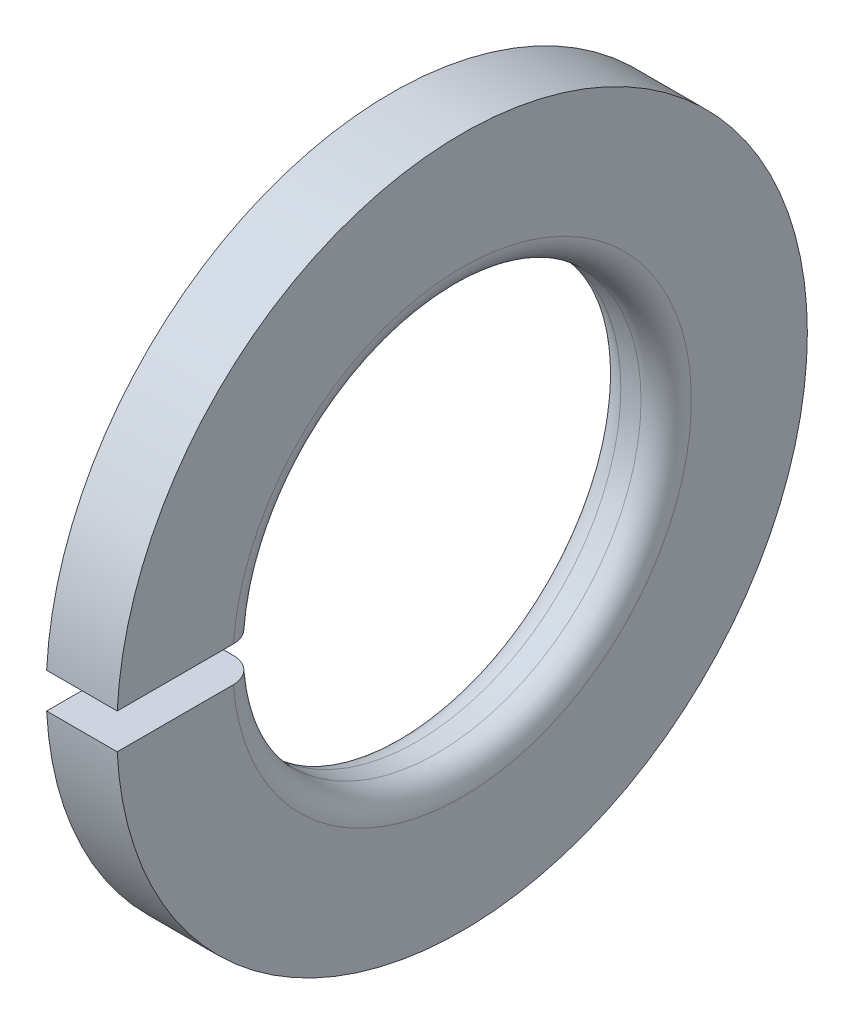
ISO-10303-21;
HEADER;
FILE_DESCRIPTION(('STEP AP214'),'2;1');
FILE_NAME('part.step','',(''),(''),'','','');
FILE_SCHEMA(('AUTOMOTIVE_DESIGN { 1 0 10303 214 1 1 1 1 }'));
ENDSEC;
DATA;
#1=APPLICATION_CONTEXT('core data for automotive mechanical design processes');
#2=APPLICATION_PROTOCOL_DEFINITION('international standard','automotive_design',2000,#1);
#3=PRODUCT_CONTEXT('',#1,'mechanical');
#4=PRODUCT('Part','Part','',(#3));
#5=PRODUCT_RELATED_PRODUCT_CATEGORY('part','',(#4));
#6=PRODUCT_DEFINITION_FORMATION('','',#4);
#7=PRODUCT_DEFINITION_CONTEXT('part definition',#1,'design');
#8=PRODUCT_DEFINITION('design','',#6,#7);
#9=PRODUCT_DEFINITION_SHAPE('','',#8);
#10=(LENGTH_UNIT() NAMED_UNIT(*) SI_UNIT(.MILLI.,.METRE.));
#11=(NAMED_UNIT(*) PLANE_ANGLE_UNIT() SI_UNIT($,.RADIAN.));
#12=(NAMED_UNIT(*) SI_UNIT($,.STERADIAN.) SOLID_ANGLE_UNIT());
#13=UNCERTAINTY_MEASURE_WITH_UNIT(LENGTH_MEASURE(1.E-05),#10,'distance_accuracy_value','');
#14=(GEOMETRIC_REPRESENTATION_CONTEXT(3) GLOBAL_UNCERTAINTY_ASSIGNED_CONTEXT((#13)) GLOBAL_UNIT_ASSIGNED_CONTEXT((#10,
#11,#12)) REPRESENTATION_CONTEXT('',''));
#15=CARTESIAN_POINT('',(0.,0.,0.));
#16=DIRECTION('',(0.,0.,1.));
#17=DIRECTION('',(1.,0.,0.));
#18=AXIS2_PLACEMENT_3D('',#15,#16,#17);
#19=CARTESIAN_POINT('',(-34.9249999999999,0.,0.));
#20=DIRECTION('',(-1.,0.,0.));
#21=DIRECTION('',(0.,0.,1.));
#22=AXIS2_PLACEMENT_3D('',#19,#20,#21);
#23=CYLINDRICAL_SURFACE('',#22,13.7);
#24=DIRECTION('',(-1.,0.,0.));
#25=VECTOR('',#24,1.);
#26=CARTESIAN_POINT('',(-34.9249999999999,0.7,13.6821051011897));
#27=LINE('',#26,#25);
#28=CARTESIAN_POINT('',(0.,0.7,13.6821051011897));
#29=VERTEX_POINT('',#28);
#30=CARTESIAN_POINT('',(-2.8,0.700000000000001,13.6821051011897));
#31=VERTEX_POINT('',#30);
#32=EDGE_CURVE('E46',#29,#31,#27,.T.);
#33=ORIENTED_EDGE('',*,*,#32,.F.);
#34=CARTESIAN_POINT('',(0.,0.,0.));
#35=DIRECTION('',(-1.,0.,0.));
#36=DIRECTION('',(0.,0.,1.));
#37=AXIS2_PLACEMENT_3D('',#34,#35,#36);
#38=CIRCLE('',#37,13.7);
#39=CARTESIAN_POINT('',(0.,-0.7,13.6821051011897));
#40=VERTEX_POINT('',#39);
#41=EDGE_CURVE('E107',#29,#40,#38,.T.);
#42=ORIENTED_EDGE('',*,*,#41,.T.);
#43=DIRECTION('',(-1.,0.,0.));
#44=VECTOR('',#43,1.);
#45=CARTESIAN_POINT('',(-34.9249999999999,-0.7,13.6821051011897));
#46=LINE('',#45,#44);
#47=CARTESIAN_POINT('',(-2.8,-0.7,13.6821051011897));
#48=VERTEX_POINT('',#47);
#49=EDGE_CURVE('E88',#48,#40,#46,.F.);
#50=ORIENTED_EDGE('',*,*,#49,.F.);
#51=CARTESIAN_POINT('',(-2.8,0.,0.));
#52=DIRECTION('',(-1.,0.,0.));
#53=DIRECTION('',(0.,0.,1.));
#54=AXIS2_PLACEMENT_3D('',#51,#52,#53);
#55=CIRCLE('',#54,13.7);
#56=EDGE_CURVE('E119',#31,#48,#55,.T.);
#57=ORIENTED_EDGE('',*,*,#56,.F.);
#58=EDGE_LOOP('',(#33,#42,#50,#57));
#59=FACE_BOUND('',#58,.T.);
#60=ADVANCED_FACE('F33',(#59),#23,.T.);
#61=CARTESIAN_POINT('',(0.,9.1,0.));
#62=DIRECTION('',(-1.,0.,0.));
#63=DIRECTION('',(0.,0.,1.));
#64=AXIS2_PLACEMENT_3D('',#61,#62,#63);
#65=PLANE('',#64);
#66=DIRECTION('',(0.,0.,-1.));
#67=VECTOR('',#66,1.);
#68=CARTESIAN_POINT('',(0.,0.7,13.974));
#69=LINE('',#68,#67);
#70=CARTESIAN_POINT('',(0.,0.7,9.073036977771));
#71=VERTEX_POINT('',#70);
#72=EDGE_CURVE('E93',#29,#71,#69,.T.);
#73=ORIENTED_EDGE('',*,*,#72,.T.);
#74=CARTESIAN_POINT('',(0.,0.,0.));
#75=DIRECTION('',(-1.,0.,0.));
#76=DIRECTION('',(0.,0.,1.));
#77=AXIS2_PLACEMENT_3D('',#74,#75,#76);
#78=CIRCLE('',#77,9.1);
#79=CARTESIAN_POINT('',(0.,-0.7,9.073036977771));
#80=VERTEX_POINT('',#79);
#81=EDGE_CURVE('E100',#71,#80,#78,.T.);
#82=ORIENTED_EDGE('',*,*,#81,.T.);
#83=DIRECTION('',(0.,0.,1.));
#84=VECTOR('',#83,1.);
#85=CARTESIAN_POINT('',(0.,-0.7,0.));
#86=LINE('',#85,#84);
#87=EDGE_CURVE('E82',#80,#40,#86,.T.);
#88=ORIENTED_EDGE('',*,*,#87,.T.);
#89=ORIENTED_EDGE('',*,*,#41,.F.);
#90=EDGE_LOOP('',(#73,#82,#88,#89));
#91=FACE_BOUND('',#90,.T.);
#92=ADVANCED_FACE('F106',(#91),#65,.F.);
#93=CARTESIAN_POINT('',(-1.,0.,0.));
#94=DIRECTION('',(-1.,0.,0.));
#95=DIRECTION('',(0.,0.,1.));
#96=AXIS2_PLACEMENT_3D('',#93,#94,#95);
#97=TOROIDAL_SURFACE('',#96,9.1,1.);
#98=ORIENTED_EDGE('',*,*,#81,.F.);
#99=CARTESIAN_POINT('',(-0.662612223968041,0.7,8.12854923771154));
#100=CARTESIAN_POINT('',(-0.715290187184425,0.7,8.10960209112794));
#101=CARTESIAN_POINT('',(-0.769604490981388,0.7,8.09508547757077));
#102=CARTESIAN_POINT('',(-0.879943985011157,0.7,8.07536673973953));
#103=CARTESIAN_POINT('',(-0.935971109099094,0.7,8.07017557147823));
#104=CARTESIAN_POINT('',(-1.04808100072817,0.7,8.06928105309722));
#105=CARTESIAN_POINT('',(-1.10416373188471,0.7,8.07357343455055));
#106=CARTESIAN_POINT('',(-1.21479686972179,0.7,8.09151311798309));
#107=CARTESIAN_POINT('',(-1.26934764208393,0.7,8.10515816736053));
#108=CARTESIAN_POINT('',(-1.37539140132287,0.7,8.1414051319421));
#109=CARTESIAN_POINT('',(-1.42688417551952,0.7,8.164007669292));
#110=CARTESIAN_POINT('',(-1.52535824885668,0.7,8.21751835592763));
#111=CARTESIAN_POINT('',(-1.57233933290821,0.7,8.24842690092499));
#112=CARTESIAN_POINT('',(-1.66057357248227,0.7,8.31774363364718));
#113=CARTESIAN_POINT('',(-1.70181327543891,0.7,8.35616894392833));
#114=CARTESIAN_POINT('',(-1.77728353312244,0.7,8.43937649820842));
#115=CARTESIAN_POINT('',(-1.81151397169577,0.7,8.48415884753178));
#116=CARTESIAN_POINT('',(-1.872118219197,0.7,8.57897480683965));
#117=CARTESIAN_POINT('',(-1.89846459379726,0.7,8.62902595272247));
#118=CARTESIAN_POINT('',(-1.94240697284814,0.7,8.73283232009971));
#119=CARTESIAN_POINT('',(-1.9600028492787,0.7,8.78658759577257));
#120=CARTESIAN_POINT('',(-1.98598908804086,0.7,8.89643434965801));
#121=CARTESIAN_POINT('',(-1.99435421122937,0.7,8.95253180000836));
#122=CARTESIAN_POINT('',(-2.001556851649,0.7,9.06533538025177));
#123=CARTESIAN_POINT('',(-2.00039428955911,0.7,9.12204151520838));
#124=CARTESIAN_POINT('',(-1.98856554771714,0.7,9.23450309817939));
#125=CARTESIAN_POINT('',(-1.97789128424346,0.7,9.29025769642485));
#126=CARTESIAN_POINT('',(-1.94732360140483,0.7,9.39917999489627));
#127=CARTESIAN_POINT('',(-1.92743021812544,0.7,9.45234770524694));
#128=CARTESIAN_POINT('',(-1.87900768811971,0.7,9.5545218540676));
#129=CARTESIAN_POINT('',(-1.85048808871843,0.7,9.6035328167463));
#130=CARTESIAN_POINT('',(-1.78560729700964,0.7,9.6960563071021));
#131=CARTESIAN_POINT('',(-1.74924619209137,0.7,9.73956889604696));
#132=CARTESIAN_POINT('',(-1.66980388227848,0.7,9.8197515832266));
#133=CARTESIAN_POINT('',(-1.62673846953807,0.7,9.85643732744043));
#134=CARTESIAN_POINT('',(-1.53504671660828,0.7,9.92203619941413));
#135=CARTESIAN_POINT('',(-1.4864204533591,0.7,9.95094943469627));
#136=CARTESIAN_POINT('',(-1.38511893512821,0.7,10.0001070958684));
#137=CARTESIAN_POINT('',(-1.33245416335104,0.7,10.0203731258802));
#138=CARTESIAN_POINT('',(-1.22446613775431,0.7,10.0517577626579));
#139=CARTESIAN_POINT('',(-1.16914291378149,0.7,10.0628764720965));
#140=CARTESIAN_POINT('',(-1.05751558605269,0.7,10.0756341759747));
#141=CARTESIAN_POINT('',(-1.00121343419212,0.7,10.0772902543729));
#142=CARTESIAN_POINT('',(-0.88913124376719,0.7,10.0711209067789));
#143=CARTESIAN_POINT('',(-0.833351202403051,0.7,10.0632955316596));
#144=CARTESIAN_POINT('',(-0.723927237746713,0.7,10.0383952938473));
#145=CARTESIAN_POINT('',(-0.670282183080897,0.7,10.0213254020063));
#146=CARTESIAN_POINT('',(-0.566615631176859,0.7,9.97842937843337));
#147=CARTESIAN_POINT('',(-0.516594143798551,0.7,9.95260322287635));
#148=CARTESIAN_POINT('',(-0.421544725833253,0.7,9.89290726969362));
#149=CARTESIAN_POINT('',(-0.376521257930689,0.7,9.8590303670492));
#150=CARTESIAN_POINT('',(-0.292786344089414,0.7,9.78421280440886));
#151=CARTESIAN_POINT('',(-0.254074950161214,0.7,9.74327208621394));
#152=CARTESIAN_POINT('',(-0.183976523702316,0.7,9.65540102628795));
#153=CARTESIAN_POINT('',(-0.152604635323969,0.7,9.60845860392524));
#154=CARTESIAN_POINT('',(-0.0981636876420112,0.7,9.50998372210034));
#155=CARTESIAN_POINT('',(-0.0750947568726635,0.7,9.45845119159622));
#156=CARTESIAN_POINT('',(-0.0378528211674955,0.7,9.35211817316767));
#157=CARTESIAN_POINT('',(-0.0237026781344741,0.7,9.29730967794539));
#158=CARTESIAN_POINT('',(-0.00478318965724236,0.7,9.18609666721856));
#159=CARTESIAN_POINT('',(-1.39876148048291E-05,0.7,9.12969212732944));
#160=CARTESIAN_POINT('',(1.39556668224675E-05,0.7,9.01675985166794));
#161=CARTESIAN_POINT('',(-0.00474764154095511,0.7,8.96023211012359));
#162=CARTESIAN_POINT('',(-0.0236862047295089,0.7,8.84877833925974));
#163=CARTESIAN_POINT('',(-0.0378628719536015,0.7,8.79385225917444));
#164=CARTESIAN_POINT('',(-0.0752439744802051,0.7,8.68712722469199));
#165=CARTESIAN_POINT('',(-0.0984536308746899,0.7,8.63533009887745));
#166=CARTESIAN_POINT('',(-0.153257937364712,0.7,8.53636087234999));
#167=CARTESIAN_POINT('',(-0.184854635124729,0.7,8.48918990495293));
#168=CARTESIAN_POINT('',(-0.255503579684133,0.7,8.40088177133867));
#169=CARTESIAN_POINT('',(-0.294549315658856,0.7,8.35973939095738));
#170=CARTESIAN_POINT('',(-0.378985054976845,0.7,8.28465942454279));
#171=CARTESIAN_POINT('',(-0.424367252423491,0.7,8.25071310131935));
#172=CARTESIAN_POINT('',(-0.502233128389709,0.7,8.20215332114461));
#173=CARTESIAN_POINT('',(-0.533197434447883,0.7,8.18505636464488));
#174=CARTESIAN_POINT('',(-0.596761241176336,0.7,8.15423425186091));
#175=CARTESIAN_POINT('',(-0.62936073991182,0.7,8.14050909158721));
#176=CARTESIAN_POINT('',(-0.662612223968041,0.7,8.12854923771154));
#177=B_SPLINE_CURVE_WITH_KNOTS('',3,(#99,#100,#101,#102,#103,#104,#105,#106,#107,#108,#109,#110,
#111,#112,#113,#114,#115,#116,#117,#118,#119,#120,#121,#122,#123,#124,#125,#126,#127,#128,#129,
#130,#131,#132,#133,#134,#135,#136,#137,#138,#139,#140,#141,#142,#143,#144,#145,#146,#147,#148,
#149,#150,#151,#152,#153,#154,#155,#156,#157,#158,#159,#160,#161,#162,#163,#164,#165,#166,#167,
#168,#169,#170,#171,#172,#173,#174,#175,#176),.UNSPECIFIED.,.T.,.F.,(4,2,2,2,2,2,2,2,2,2,2,2,2,
2,2,2,2,2,2,2,2,2,2,2,2,2,2,2,2,2,2,2,2,2,2,2,2,2,4),(0.,0.167816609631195,0.335830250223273,
0.503768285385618,0.671665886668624,0.839575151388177,1.0074924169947,1.17579673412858,
1.34410384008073,1.51298997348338,1.68187857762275,1.85122782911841,2.02057849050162,
2.19007321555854,2.35956727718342,2.5288744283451,2.69817969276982,2.86709202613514,
3.03600202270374,3.20448750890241,3.3729711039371,3.54115042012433,3.70932883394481,
3.87741690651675,4.04550543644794,4.21374286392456,4.38198167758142,4.55056462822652,
4.7191501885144,4.88816615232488,5.05718469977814,5.22656431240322,5.39593855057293,
5.5654108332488,5.73492453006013,5.9042907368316,6.07345011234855,6.17937975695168,
6.28530927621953),.UNSPECIFIED.);
#178=CARTESIAN_POINT('',(-1.,0.7,8.06969640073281));
#179=VERTEX_POINT('',#178);
#180=EDGE_CURVE('E126',#71,#179,#177,.T.);
#181=ORIENTED_EDGE('',*,*,#180,.T.);
#182=CARTESIAN_POINT('',(-1.,0.,0.));
#183=DIRECTION('',(-1.,0.,0.));
#184=DIRECTION('',(0.,0.,1.));
#185=AXIS2_PLACEMENT_3D('',#182,#183,#184);
#186=CIRCLE('',#185,8.1);
#187=CARTESIAN_POINT('',(-1.,-0.7,8.06969640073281));
#188=VERTEX_POINT('',#187);
#189=EDGE_CURVE('E102',#179,#188,#186,.T.);
#190=ORIENTED_EDGE('',*,*,#189,.T.);
#191=CARTESIAN_POINT('',(-0.662612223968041,-0.7,8.12854923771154));
#192=CARTESIAN_POINT('',(-0.609750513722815,-0.7,8.14756782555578));
#193=CARTESIAN_POINT('',(-0.558459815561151,-0.7,8.17107597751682));
#194=CARTESIAN_POINT('',(-0.460516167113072,-0.7,8.22639837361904));
#195=CARTESIAN_POINT('',(-0.41386902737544,-0.7,8.25822284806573));
#196=CARTESIAN_POINT('',(-0.326601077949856,-0.7,8.32922967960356));
#197=CARTESIAN_POINT('',(-0.285976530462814,-0.7,8.36840743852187));
#198=CARTESIAN_POINT('',(-0.211872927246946,-0.7,8.45300084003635));
#199=CARTESIAN_POINT('',(-0.178392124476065,-0.7,8.49841495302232));
#200=CARTESIAN_POINT('',(-0.119415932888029,-0.7,8.59432631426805));
#201=CARTESIAN_POINT('',(-0.0939416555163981,-0.7,8.64483654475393));
#202=CARTESIAN_POINT('',(-0.0518077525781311,-0.7,8.74941094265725));
#203=CARTESIAN_POINT('',(-0.0351486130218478,-0.7,8.80347530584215));
#204=CARTESIAN_POINT('',(-0.0110795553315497,-0.7,8.91377475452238));
#205=CARTESIAN_POINT('',(-0.00369410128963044,-0.7,8.97001517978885));
#206=CARTESIAN_POINT('',(0.00153797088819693,-0.7,9.08293817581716));
#207=CARTESIAN_POINT('',(-0.000615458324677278,-0.7,9.13962074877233));
#208=CARTESIAN_POINT('',(-0.0144095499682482,-0.7,9.25186291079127));
#209=CARTESIAN_POINT('',(-0.0260572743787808,-0.7,9.30742163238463));
#210=CARTESIAN_POINT('',(-0.0585259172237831,-0.7,9.41579093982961));
#211=CARTESIAN_POINT('',(-0.0793467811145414,-0.7,9.46860154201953));
#212=CARTESIAN_POINT('',(-0.129548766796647,-0.7,9.56990606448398));
#213=CARTESIAN_POINT('',(-0.158919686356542,-0.7,9.61840504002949));
#214=CARTESIAN_POINT('',(-0.225405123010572,-0.7,9.70976838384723));
#215=CARTESIAN_POINT('',(-0.262519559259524,-0.7,9.75263281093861));
#216=CARTESIAN_POINT('',(-0.343345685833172,-0.7,9.83140145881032));
#217=CARTESIAN_POINT('',(-0.387041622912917,-0.7,9.86732184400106));
#218=CARTESIAN_POINT('',(-0.47985649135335,-0.7,9.93129490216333));
#219=CARTESIAN_POINT('',(-0.528975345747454,-0.7,9.95934768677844));
#220=CARTESIAN_POINT('',(-0.631109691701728,-0.7,10.0067167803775));
#221=CARTESIAN_POINT('',(-0.684115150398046,-0.7,10.0260547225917));
#222=CARTESIAN_POINT('',(-0.792623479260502,-0.7,10.0555396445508));
#223=CARTESIAN_POINT('',(-0.848126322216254,-0.7,10.0656867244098));
#224=CARTESIAN_POINT('',(-0.959949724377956,-0.7,10.0764877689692));
#225=CARTESIAN_POINT('',(-1.0162686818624,-0.7,10.0771583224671));
#226=CARTESIAN_POINT('',(-1.12821880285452,-0.7,10.0690298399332));
#227=CARTESIAN_POINT('',(-1.18384996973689,-0.7,10.0602308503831));
#228=CARTESIAN_POINT('',(-1.29281928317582,-0.7,10.0334227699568));
#229=CARTESIAN_POINT('',(-1.34615848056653,-0.7,10.015417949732));
#230=CARTESIAN_POINT('',(-1.4490611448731,-0.7,9.970717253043));
#231=CARTESIAN_POINT('',(-1.49862460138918,-0.7,9.94402135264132));
#232=CARTESIAN_POINT('',(-1.59262209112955,-0.7,9.88267285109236));
#233=CARTESIAN_POINT('',(-1.63705117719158,-0.7,9.84801267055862));
#234=CARTESIAN_POINT('',(-1.71947489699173,-0.7,9.77173948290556));
#235=CARTESIAN_POINT('',(-1.75746946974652,-0.7,9.73012640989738));
#236=CARTESIAN_POINT('',(-1.82603230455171,-0.7,9.64103705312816));
#237=CARTESIAN_POINT('',(-1.85658487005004,-0.7,9.59354868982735));
#238=CARTESIAN_POINT('',(-1.90930732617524,-0.7,9.49412689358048));
#239=CARTESIAN_POINT('',(-1.93147709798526,-0.7,9.44219339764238));
#240=CARTESIAN_POINT('',(-1.96686389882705,-0.7,9.33521335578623));
#241=CARTESIAN_POINT('',(-1.98005788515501,-0.7,9.28015918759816));
#242=CARTESIAN_POINT('',(-1.99703688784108,-0.7,9.16861858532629));
#243=CARTESIAN_POINT('',(-2.00082178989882,-0.7,9.11213213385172));
#244=CARTESIAN_POINT('',(-1.99887833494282,-0.7,8.99920600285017));
#245=CARTESIAN_POINT('',(-1.99313030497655,-0.7,8.94276666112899));
#246=CARTESIAN_POINT('',(-1.97224664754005,-0.7,8.83165188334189));
#247=CARTESIAN_POINT('',(-1.95711093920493,-0.7,8.77697646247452));
#248=CARTESIAN_POINT('',(-1.91786481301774,-0.7,8.67091052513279));
#249=CARTESIAN_POINT('',(-1.89374914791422,-0.7,8.61952194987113));
#250=CARTESIAN_POINT('',(-1.83722070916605,-0.7,8.52153046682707));
#251=CARTESIAN_POINT('',(-1.80480795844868,-0.7,8.474927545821));
#252=CARTESIAN_POINT('',(-1.73264985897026,-0.7,8.3879067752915));
#253=CARTESIAN_POINT('',(-1.69291510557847,-0.7,8.347480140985));
#254=CARTESIAN_POINT('',(-1.60720532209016,-0.7,8.27389845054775));
#255=CARTESIAN_POINT('',(-1.56123063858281,-0.7,8.24074299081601));
#256=CARTESIAN_POINT('',(-1.46450243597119,-0.7,8.18275770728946));
#257=CARTESIAN_POINT('',(-1.4137647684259,-0.7,8.15790143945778));
#258=CARTESIAN_POINT('',(-1.30881264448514,-0.7,8.11708643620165));
#259=CARTESIAN_POINT('',(-1.25459739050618,-0.7,8.10112975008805));
#260=CARTESIAN_POINT('',(-1.14441413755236,-0.7,8.07862035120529));
#261=CARTESIAN_POINT('',(-1.08845152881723,-0.7,8.07204117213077));
#262=CARTESIAN_POINT('',(-0.976264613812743,-0.7,8.06840287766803));
#263=CARTESIAN_POINT('',(-0.920040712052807,-0.7,8.07133211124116));
#264=CARTESIAN_POINT('',(-0.830102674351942,-0.7,8.08367379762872));
#265=CARTESIAN_POINT('',(-0.795965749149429,-0.7,8.09019440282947));
#266=CARTESIAN_POINT('',(-0.728556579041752,-0.7,8.10675474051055));
#267=CARTESIAN_POINT('',(-0.695284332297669,-0.7,8.11679446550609));
#268=CARTESIAN_POINT('',(-0.662612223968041,-0.7,8.12854923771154));
#269=B_SPLINE_CURVE_WITH_KNOTS('',3,(#191,#192,#193,#194,#195,#196,#197,#198,#199,#200,#201,
#202,#203,#204,#205,#206,#207,#208,#209,#210,#211,#212,#213,#214,#215,#216,#217,#218,#219,#220,
#221,#222,#223,#224,#225,#226,#227,#228,#229,#230,#231,#232,#233,#234,#235,#236,#237,#238,#239,
#240,#241,#242,#243,#244,#245,#246,#247,#248,#249,#250,#251,#252,#253,#254,#255,#256,#257,#258,
#259,#260,#261,#262,#263,#264,#265,#266,#267,#268),.UNSPECIFIED.,.T.,.F.,(4,2,2,2,2,2,2,2,2,2,2,
2,2,2,2,2,2,2,2,2,2,2,2,2,2,2,2,2,2,2,2,2,2,2,2,2,2,2,4),(0.,0.16840937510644,0.337026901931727,
0.505539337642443,0.67401051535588,0.842922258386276,1.01184331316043,1.1812090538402,
1.35057563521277,1.52006830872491,1.68955997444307,1.85885021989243,2.02813869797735,
2.19702822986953,2.3659153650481,2.53438092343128,2.70284464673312,2.8710134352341,
3.03918139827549,3.20727141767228,3.37536190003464,3.54361301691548,3.71186572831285,
3.88047030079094,4.04907726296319,4.21811545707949,4.38715570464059,4.55654523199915,
4.72593621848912,4.89542634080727,5.06491599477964,5.23416228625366,5.40339918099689,
5.57209156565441,5.74082277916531,5.90907683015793,6.07712479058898,6.18121338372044,
6.28530175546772),.UNSPECIFIED.);
#270=EDGE_CURVE('E85',#188,#80,#269,.T.);
#271=ORIENTED_EDGE('',*,*,#270,.T.);
#272=EDGE_LOOP('',(#98,#181,#190,#271));
#273=FACE_BOUND('',#272,.T.);
#274=ADVANCED_FACE('F98',(#273),#97,.T.);
#275=CARTESIAN_POINT('',(-34.9249999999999,0.,0.));
#276=DIRECTION('',(-1.,0.,0.));
#277=DIRECTION('',(0.,0.,1.));
#278=AXIS2_PLACEMENT_3D('',#275,#276,#277);
#279=CYLINDRICAL_SURFACE('',#278,8.1);
#280=DIRECTION('',(-1.,0.,0.));
#281=VECTOR('',#280,1.);
#282=CARTESIAN_POINT('',(-34.9249999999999,0.7,8.06969640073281));
#283=LINE('',#282,#281);
#284=CARTESIAN_POINT('',(-1.8,0.7,8.06969640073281));
#285=VERTEX_POINT('',#284);
#286=EDGE_CURVE('E134',#285,#179,#283,.F.);
#287=ORIENTED_EDGE('',*,*,#286,.F.);
#288=CARTESIAN_POINT('',(-1.8,0.,0.));
#289=DIRECTION('',(-1.,0.,0.));
#290=DIRECTION('',(0.,0.,1.));
#291=AXIS2_PLACEMENT_3D('',#288,#289,#290);
#292=CIRCLE('',#291,8.1);
#293=CARTESIAN_POINT('',(-1.8,-0.7,8.0696964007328));
#294=VERTEX_POINT('',#293);
#295=EDGE_CURVE('E110',#285,#294,#292,.T.);
#296=ORIENTED_EDGE('',*,*,#295,.T.);
#297=DIRECTION('',(-1.,0.,0.));
#298=VECTOR('',#297,1.);
#299=CARTESIAN_POINT('',(-34.9249999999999,-0.7,8.06969640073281));
#300=LINE('',#299,#298);
#301=EDGE_CURVE('E103',#188,#294,#300,.T.);
#302=ORIENTED_EDGE('',*,*,#301,.F.);
#303=ORIENTED_EDGE('',*,*,#189,.F.);
#304=EDGE_LOOP('',(#287,#296,#302,#303));
#305=FACE_BOUND('',#304,.T.);
#306=ADVANCED_FACE('F133',(#305),#279,.F.);
#307=CARTESIAN_POINT('',(-1.8,0.,0.));
#308=DIRECTION('',(-1.,0.,0.));
#309=DIRECTION('',(0.,0.,1.));
#310=AXIS2_PLACEMENT_3D('',#307,#308,#309);
#311=TOROIDAL_SURFACE('',#310,9.1,1.);
#312=ORIENTED_EDGE('',*,*,#295,.F.);
#313=CARTESIAN_POINT('',(-2.13738777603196,0.7,8.12854923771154));
#314=CARTESIAN_POINT('',(-2.19024948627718,0.7,8.14756782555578));
#315=CARTESIAN_POINT('',(-2.24154018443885,0.7,8.17107597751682));
#316=CARTESIAN_POINT('',(-2.33948383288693,0.7,8.22639837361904));
#317=CARTESIAN_POINT('',(-2.38613097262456,0.7,8.25822284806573));
#318=CARTESIAN_POINT('',(-2.47339892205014,0.7,8.32922967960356));
#319=CARTESIAN_POINT('',(-2.51402346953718,0.7,8.36840743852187));
#320=CARTESIAN_POINT('',(-2.58812707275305,0.7,8.45300084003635));
#321=CARTESIAN_POINT('',(-2.62160787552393,0.7,8.49841495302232));
#322=CARTESIAN_POINT('',(-2.68058406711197,0.7,8.59432631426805));
#323=CARTESIAN_POINT('',(-2.7060583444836,0.7,8.64483654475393));
#324=CARTESIAN_POINT('',(-2.74819224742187,0.7,8.74941094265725));
#325=CARTESIAN_POINT('',(-2.76485138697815,0.7,8.80347530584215));
#326=CARTESIAN_POINT('',(-2.78892044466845,0.7,8.91377475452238));
#327=CARTESIAN_POINT('',(-2.79630589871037,0.7,8.97001517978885));
#328=CARTESIAN_POINT('',(-2.8015379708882,0.7,9.08293817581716));
#329=CARTESIAN_POINT('',(-2.79938454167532,0.7,9.13962074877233));
#330=CARTESIAN_POINT('',(-2.78559045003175,0.7,9.25186291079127));
#331=CARTESIAN_POINT('',(-2.77394272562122,0.7,9.30742163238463));
#332=CARTESIAN_POINT('',(-2.74147408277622,0.7,9.41579093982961));
#333=CARTESIAN_POINT('',(-2.72065321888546,0.7,9.46860154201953));
#334=CARTESIAN_POINT('',(-2.67045123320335,0.7,9.56990606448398));
#335=CARTESIAN_POINT('',(-2.64108031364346,0.7,9.61840504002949));
#336=CARTESIAN_POINT('',(-2.57459487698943,0.7,9.70976838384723));
#337=CARTESIAN_POINT('',(-2.53748044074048,0.7,9.75263281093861));
#338=CARTESIAN_POINT('',(-2.45665431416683,0.7,9.83140145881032));
#339=CARTESIAN_POINT('',(-2.41295837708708,0.7,9.86732184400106));
#340=CARTESIAN_POINT('',(-2.32014350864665,0.7,9.93129490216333));
#341=CARTESIAN_POINT('',(-2.27102465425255,0.7,9.95934768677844));
#342=CARTESIAN_POINT('',(-2.16889030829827,0.7,10.0067167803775));
#343=CARTESIAN_POINT('',(-2.11588484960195,0.7,10.0260547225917));
#344=CARTESIAN_POINT('',(-2.0073765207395,0.7,10.0555396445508));
#345=CARTESIAN_POINT('',(-1.95187367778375,0.7,10.0656867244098));
#346=CARTESIAN_POINT('',(-1.84005027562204,0.7,10.0764877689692));
#347=CARTESIAN_POINT('',(-1.7837313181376,0.7,10.0771583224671));
#348=CARTESIAN_POINT('',(-1.67178119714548,0.7,10.0690298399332));
#349=CARTESIAN_POINT('',(-1.61615003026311,0.7,10.0602308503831));
#350=CARTESIAN_POINT('',(-1.50718071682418,0.7,10.0334227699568));
#351=CARTESIAN_POINT('',(-1.45384151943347,0.7,10.015417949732));
#352=CARTESIAN_POINT('',(-1.3509388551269,0.7,9.970717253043));
#353=CARTESIAN_POINT('',(-1.30137539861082,0.7,9.94402135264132));
#354=CARTESIAN_POINT('',(-1.20737790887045,0.7,9.88267285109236));
#355=CARTESIAN_POINT('',(-1.16294882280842,0.7,9.84801267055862));
#356=CARTESIAN_POINT('',(-1.08052510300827,0.7,9.77173948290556));
#357=CARTESIAN_POINT('',(-1.04253053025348,0.7,9.73012640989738));
#358=CARTESIAN_POINT('',(-0.973967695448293,0.7,9.64103705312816));
#359=CARTESIAN_POINT('',(-0.943415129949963,0.7,9.59354868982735));
#360=CARTESIAN_POINT('',(-0.890692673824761,0.7,9.49412689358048));
#361=CARTESIAN_POINT('',(-0.868522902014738,0.7,9.44219339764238));
#362=CARTESIAN_POINT('',(-0.83313610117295,0.7,9.33521335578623));
#363=CARTESIAN_POINT('',(-0.81994211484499,0.7,9.28015918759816));
#364=CARTESIAN_POINT('',(-0.802963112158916,0.7,9.16861858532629));
#365=CARTESIAN_POINT('',(-0.799178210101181,0.7,9.11213213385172));
#366=CARTESIAN_POINT('',(-0.801121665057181,0.7,8.99920600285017));
#367=CARTESIAN_POINT('',(-0.806869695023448,0.7,8.94276666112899));
#368=CARTESIAN_POINT('',(-0.827753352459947,0.7,8.83165188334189));
#369=CARTESIAN_POINT('',(-0.842889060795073,0.7,8.77697646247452));
#370=CARTESIAN_POINT('',(-0.882135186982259,0.7,8.67091052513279));
#371=CARTESIAN_POINT('',(-0.906250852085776,0.7,8.61952194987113));
#372=CARTESIAN_POINT('',(-0.962779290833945,0.7,8.52153046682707));
#373=CARTESIAN_POINT('',(-0.995192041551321,0.7,8.474927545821));
#374=CARTESIAN_POINT('',(-1.06735014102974,0.7,8.3879067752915));
#375=CARTESIAN_POINT('',(-1.10708489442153,0.7,8.347480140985));
#376=CARTESIAN_POINT('',(-1.19279467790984,0.7,8.27389845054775));
#377=CARTESIAN_POINT('',(-1.23876936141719,0.7,8.24074299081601));
#378=CARTESIAN_POINT('',(-1.33549756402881,0.7,8.18275770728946));
#379=CARTESIAN_POINT('',(-1.38623523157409,0.7,8.15790143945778));
#380=CARTESIAN_POINT('',(-1.49118735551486,0.7,8.11708643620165));
#381=CARTESIAN_POINT('',(-1.54540260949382,0.7,8.10112975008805));
#382=CARTESIAN_POINT('',(-1.65558586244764,0.7,8.07862035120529));
#383=CARTESIAN_POINT('',(-1.71154847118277,0.7,8.07204117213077));
#384=CARTESIAN_POINT('',(-1.82373538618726,0.7,8.06840287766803));
#385=CARTESIAN_POINT('',(-1.87995928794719,0.7,8.07133211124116));
#386=CARTESIAN_POINT('',(-1.96989732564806,0.7,8.08367379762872));
#387=CARTESIAN_POINT('',(-2.00403425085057,0.7,8.09019440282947));
#388=CARTESIAN_POINT('',(-2.07144342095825,0.7,8.10675474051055));
#389=CARTESIAN_POINT('',(-2.10471566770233,0.7,8.11679446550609));
#390=CARTESIAN_POINT('',(-2.13738777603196,0.7,8.12854923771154));
#391=B_SPLINE_CURVE_WITH_KNOTS('',3,(#313,#314,#315,#316,#317,#318,#319,#320,#321,#322,#323,
#324,#325,#326,#327,#328,#329,#330,#331,#332,#333,#334,#335,#336,#337,#338,#339,#340,#341,#342,
#343,#344,#345,#346,#347,#348,#349,#350,#351,#352,#353,#354,#355,#356,#357,#358,#359,#360,#361,
#362,#363,#364,#365,#366,#367,#368,#369,#370,#371,#372,#373,#374,#375,#376,#377,#378,#379,#380,
#381,#382,#383,#384,#385,#386,#387,#388,#389,#390),.UNSPECIFIED.,.T.,.F.,(4,2,2,2,2,2,2,2,2,2,2,
2,2,2,2,2,2,2,2,2,2,2,2,2,2,2,2,2,2,2,2,2,2,2,2,2,2,2,4),(0.,0.16840937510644,0.337026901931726,
0.50553933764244,0.67401051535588,0.842922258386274,1.01184331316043,1.1812090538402,
1.35057563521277,1.5200683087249,1.68955997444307,1.85885021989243,2.02813869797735,
2.19702822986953,2.3659153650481,2.53438092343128,2.70284464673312,2.8710134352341,
3.03918139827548,3.20727141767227,3.37536190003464,3.54361301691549,3.71186572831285,
3.88047030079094,4.04907726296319,4.21811545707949,4.3871557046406,4.55654523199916,
4.72593621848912,4.89542634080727,5.06491599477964,5.23416228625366,5.40339918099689,
5.57209156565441,5.74082277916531,5.90907683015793,6.07712479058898,6.18121338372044,
6.28530175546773),.UNSPECIFIED.);
#392=CARTESIAN_POINT('',(-2.8,0.7,9.07303697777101));
#393=VERTEX_POINT('',#392);
#394=EDGE_CURVE('E120',#285,#393,#391,.T.);
#395=ORIENTED_EDGE('',*,*,#394,.T.);
#396=CARTESIAN_POINT('',(-2.8,0.,0.));
#397=DIRECTION('',(-1.,0.,0.));
#398=DIRECTION('',(0.,0.,1.));
#399=AXIS2_PLACEMENT_3D('',#396,#397,#398);
#400=CIRCLE('',#399,9.1);
#401=CARTESIAN_POINT('',(-2.8,-0.699999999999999,9.073036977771));
#402=VERTEX_POINT('',#401);
#403=EDGE_CURVE('E123',#393,#402,#400,.T.);
#404=ORIENTED_EDGE('',*,*,#403,.T.);
#405=CARTESIAN_POINT('',(-2.13738777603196,-0.7,8.12854923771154));
#406=CARTESIAN_POINT('',(-2.08470981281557,-0.7,8.10960209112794));
#407=CARTESIAN_POINT('',(-2.03039550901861,-0.7,8.09508547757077));
#408=CARTESIAN_POINT('',(-1.92005601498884,-0.7,8.07536673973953));
#409=CARTESIAN_POINT('',(-1.86402889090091,-0.7,8.07017557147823));
#410=CARTESIAN_POINT('',(-1.75191899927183,-0.7,8.06928105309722));
#411=CARTESIAN_POINT('',(-1.69583626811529,-0.7,8.07357343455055));
#412=CARTESIAN_POINT('',(-1.58520313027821,-0.7,8.09151311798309));
#413=CARTESIAN_POINT('',(-1.53065235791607,-0.7,8.10515816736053));
#414=CARTESIAN_POINT('',(-1.42460859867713,-0.7,8.1414051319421));
#415=CARTESIAN_POINT('',(-1.37311582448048,-0.7,8.164007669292));
#416=CARTESIAN_POINT('',(-1.27464175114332,-0.7,8.21751835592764));
#417=CARTESIAN_POINT('',(-1.22766066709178,-0.7,8.24842690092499));
#418=CARTESIAN_POINT('',(-1.13942642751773,-0.7,8.31774363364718));
#419=CARTESIAN_POINT('',(-1.09818672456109,-0.7,8.35616894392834));
#420=CARTESIAN_POINT('',(-1.02271646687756,-0.7,8.43937649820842));
#421=CARTESIAN_POINT('',(-0.988486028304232,-0.7,8.48415884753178));
#422=CARTESIAN_POINT('',(-0.927881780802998,-0.7,8.57897480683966));
#423=CARTESIAN_POINT('',(-0.901535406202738,-0.7,8.62902595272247));
#424=CARTESIAN_POINT('',(-0.857593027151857,-0.7,8.73283232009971));
#425=CARTESIAN_POINT('',(-0.839997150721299,-0.7,8.78658759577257));
#426=CARTESIAN_POINT('',(-0.814010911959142,-0.7,8.89643434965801));
#427=CARTESIAN_POINT('',(-0.805645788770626,-0.7,8.95253180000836));
#428=CARTESIAN_POINT('',(-0.798443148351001,-0.7,9.06533538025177));
#429=CARTESIAN_POINT('',(-0.799605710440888,-0.7,9.12204151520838));
#430=CARTESIAN_POINT('',(-0.811434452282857,-0.7,9.23450309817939));
#431=CARTESIAN_POINT('',(-0.822108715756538,-0.7,9.29025769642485));
#432=CARTESIAN_POINT('',(-0.852676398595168,-0.7,9.39917999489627));
#433=CARTESIAN_POINT('',(-0.872569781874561,-0.7,9.45234770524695));
#434=CARTESIAN_POINT('',(-0.920992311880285,-0.7,9.5545218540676));
#435=CARTESIAN_POINT('',(-0.949511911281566,-0.7,9.6035328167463));
#436=CARTESIAN_POINT('',(-1.01439270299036,-0.7,9.6960563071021));
#437=CARTESIAN_POINT('',(-1.05075380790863,-0.7,9.73956889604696));
#438=CARTESIAN_POINT('',(-1.13019611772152,-0.7,9.8197515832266));
#439=CARTESIAN_POINT('',(-1.17326153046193,-0.7,9.85643732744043));
#440=CARTESIAN_POINT('',(-1.26495328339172,-0.7,9.92203619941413));
#441=CARTESIAN_POINT('',(-1.3135795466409,-0.7,9.95094943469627));
#442=CARTESIAN_POINT('',(-1.41488106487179,-0.7,10.0001070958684));
#443=CARTESIAN_POINT('',(-1.46754583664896,-0.7,10.0203731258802));
#444=CARTESIAN_POINT('',(-1.57553386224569,-0.7,10.0517577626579));
#445=CARTESIAN_POINT('',(-1.63085708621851,-0.7,10.0628764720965));
#446=CARTESIAN_POINT('',(-1.74248441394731,-0.7,10.0756341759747));
#447=CARTESIAN_POINT('',(-1.79878656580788,-0.7,10.0772902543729));
#448=CARTESIAN_POINT('',(-1.91086875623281,-0.7,10.0711209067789));
#449=CARTESIAN_POINT('',(-1.96664879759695,-0.7,10.0632955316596));
#450=CARTESIAN_POINT('',(-2.07607276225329,-0.7,10.0383952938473));
#451=CARTESIAN_POINT('',(-2.1297178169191,-0.7,10.0213254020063));
#452=CARTESIAN_POINT('',(-2.23338436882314,-0.7,9.97842937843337));
#453=CARTESIAN_POINT('',(-2.28340585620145,-0.7,9.95260322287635));
#454=CARTESIAN_POINT('',(-2.37845527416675,-0.7,9.89290726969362));
#455=CARTESIAN_POINT('',(-2.42347874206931,-0.7,9.8590303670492));
#456=CARTESIAN_POINT('',(-2.50721365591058,-0.7,9.78421280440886));
#457=CARTESIAN_POINT('',(-2.54592504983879,-0.7,9.74327208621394));
#458=CARTESIAN_POINT('',(-2.61602347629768,-0.7,9.65540102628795));
#459=CARTESIAN_POINT('',(-2.64739536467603,-0.7,9.60845860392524));
#460=CARTESIAN_POINT('',(-2.70183631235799,-0.7,9.50998372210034));
#461=CARTESIAN_POINT('',(-2.72490524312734,-0.7,9.45845119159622));
#462=CARTESIAN_POINT('',(-2.7621471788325,-0.7,9.35211817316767));
#463=CARTESIAN_POINT('',(-2.77629732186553,-0.7,9.29730967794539));
#464=CARTESIAN_POINT('',(-2.79521681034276,-0.7,9.18609666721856));
#465=CARTESIAN_POINT('',(-2.79998601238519,-0.7,9.12969212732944));
#466=CARTESIAN_POINT('',(-2.80001395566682,-0.7,9.01675985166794));
#467=CARTESIAN_POINT('',(-2.79525235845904,-0.7,8.96023211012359));
#468=CARTESIAN_POINT('',(-2.77631379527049,-0.7,8.84877833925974));
#469=CARTESIAN_POINT('',(-2.7621371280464,-0.7,8.79385225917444));
#470=CARTESIAN_POINT('',(-2.72475602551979,-0.7,8.68712722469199));
#471=CARTESIAN_POINT('',(-2.70154636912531,-0.7,8.63533009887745));
#472=CARTESIAN_POINT('',(-2.64674206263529,-0.7,8.53636087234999));
#473=CARTESIAN_POINT('',(-2.61514536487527,-0.7,8.48918990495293));
#474=CARTESIAN_POINT('',(-2.54449642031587,-0.7,8.40088177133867));
#475=CARTESIAN_POINT('',(-2.50545068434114,-0.7,8.35973939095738));
#476=CARTESIAN_POINT('',(-2.42101494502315,-0.7,8.28465942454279));
#477=CARTESIAN_POINT('',(-2.37563274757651,-0.7,8.25071310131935));
#478=CARTESIAN_POINT('',(-2.29776687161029,-0.7,8.20215332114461));
#479=CARTESIAN_POINT('',(-2.26680256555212,-0.7,8.18505636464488));
#480=CARTESIAN_POINT('',(-2.20323875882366,-0.7,8.15423425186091));
#481=CARTESIAN_POINT('',(-2.17063926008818,-0.7,8.14050909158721));
#482=CARTESIAN_POINT('',(-2.13738777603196,-0.7,8.12854923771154));
#483=B_SPLINE_CURVE_WITH_KNOTS('',3,(#405,#406,#407,#408,#409,#410,#411,#412,#413,#414,#415,
#416,#417,#418,#419,#420,#421,#422,#423,#424,#425,#426,#427,#428,#429,#430,#431,#432,#433,#434,
#435,#436,#437,#438,#439,#440,#441,#442,#443,#444,#445,#446,#447,#448,#449,#450,#451,#452,#453,
#454,#455,#456,#457,#458,#459,#460,#461,#462,#463,#464,#465,#466,#467,#468,#469,#470,#471,#472,
#473,#474,#475,#476,#477,#478,#479,#480,#481,#482),.UNSPECIFIED.,.T.,.F.,(4,2,2,2,2,2,2,2,2,2,2,
2,2,2,2,2,2,2,2,2,2,2,2,2,2,2,2,2,2,2,2,2,2,2,2,2,2,2,4),(0.,0.167816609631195,
0.335830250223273,0.503768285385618,0.671665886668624,0.839575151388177,1.0074924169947,
1.17579673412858,1.34410384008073,1.51298997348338,1.68187857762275,1.85122782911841,
2.02057849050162,2.19007321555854,2.35956727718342,2.5288744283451,2.69817969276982,
2.86709202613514,3.03600202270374,3.20448750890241,3.3729711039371,3.54115042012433,
3.70932883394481,3.87741690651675,4.04550543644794,4.21374286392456,4.38198167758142,
4.55056462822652,4.7191501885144,4.88816615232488,5.05718469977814,5.22656431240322,
5.39593855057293,5.5654108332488,5.73492453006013,5.9042907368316,6.07345011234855,
6.17937975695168,6.28530927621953),.UNSPECIFIED.);
#484=EDGE_CURVE('E54',#402,#294,#483,.T.);
#485=ORIENTED_EDGE('',*,*,#484,.T.);
#486=EDGE_LOOP('',(#312,#395,#404,#485));
#487=FACE_BOUND('',#486,.T.);
#488=ADVANCED_FACE('F137',(#487),#311,.T.);
#489=CARTESIAN_POINT('',(-2.8,13.7,0.));
#490=DIRECTION('',(1.,0.,0.));
#491=DIRECTION('',(0.,0.,-1.));
#492=AXIS2_PLACEMENT_3D('',#489,#490,#491);
#493=PLANE('',#492);
#494=DIRECTION('',(0.,0.,-1.));
#495=VECTOR('',#494,1.);
#496=CARTESIAN_POINT('',(-2.8,0.700000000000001,0.));
#497=LINE('',#496,#495);
#498=EDGE_CURVE('E11',#31,#393,#497,.T.);
#499=ORIENTED_EDGE('',*,*,#498,.F.);
#500=ORIENTED_EDGE('',*,*,#56,.T.);
#501=DIRECTION('',(0.,0.,1.));
#502=VECTOR('',#501,1.);
#503=CARTESIAN_POINT('',(-2.8,-0.699999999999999,0.));
#504=LINE('',#503,#502);
#505=EDGE_CURVE('E40',#402,#48,#504,.T.);
#506=ORIENTED_EDGE('',*,*,#505,.F.);
#507=ORIENTED_EDGE('',*,*,#403,.F.);
#508=EDGE_LOOP('',(#499,#500,#506,#507));
#509=FACE_BOUND('',#508,.T.);
#510=ADVANCED_FACE('F122',(#509),#493,.F.);
#511=CARTESIAN_POINT('',(-2.8,-0.7,0.));
#512=DIRECTION('',(0.,1.,0.));
#513=DIRECTION('',(0.,0.,1.));
#514=AXIS2_PLACEMENT_3D('',#511,#512,#513);
#515=PLANE('',#514);
#516=ORIENTED_EDGE('',*,*,#49,.T.);
#517=ORIENTED_EDGE('',*,*,#87,.F.);
#518=ORIENTED_EDGE('',*,*,#270,.F.);
#519=ORIENTED_EDGE('',*,*,#301,.T.);
#520=ORIENTED_EDGE('',*,*,#484,.F.);
#521=ORIENTED_EDGE('',*,*,#505,.T.);
#522=EDGE_LOOP('',(#516,#517,#518,#519,#520,#521));
#523=FACE_BOUND('',#522,.T.);
#524=ADVANCED_FACE('F84',(#523),#515,.T.);
#525=CARTESIAN_POINT('',(-2.8,0.7,13.974));
#526=DIRECTION('',(0.,-1.,0.));
#527=DIRECTION('',(0.,0.,-1.));
#528=AXIS2_PLACEMENT_3D('',#525,#526,#527);
#529=PLANE('',#528);
#530=ORIENTED_EDGE('',*,*,#32,.T.);
#531=ORIENTED_EDGE('',*,*,#498,.T.);
#532=ORIENTED_EDGE('',*,*,#394,.F.);
#533=ORIENTED_EDGE('',*,*,#286,.T.);
#534=ORIENTED_EDGE('',*,*,#180,.F.);
#535=ORIENTED_EDGE('',*,*,#72,.F.);
#536=EDGE_LOOP('',(#530,#531,#532,#533,#534,#535));
#537=FACE_BOUND('',#536,.T.);
#538=ADVANCED_FACE('F151',(#537),#529,.T.);
#539=CLOSED_SHELL('',(#60,#92,#274,#306,#488,#510,#524,#538));
#540=MANIFOLD_SOLID_BREP('B2',#539);
#541=ADVANCED_BREP_SHAPE_REPRESENTATION('',(#18,#540),#14);
#542=SHAPE_DEFINITION_REPRESENTATION(#9,#541);
ENDSEC;
END-ISO-10303-21;
